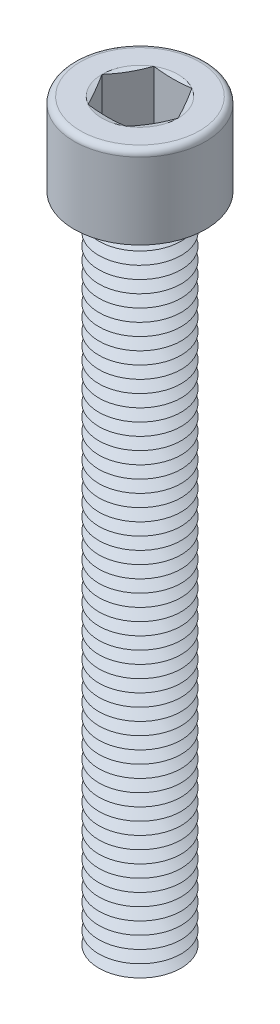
from build123d import *

# Parameters (mm, degrees)
SKETCH1_R       = 5
EXTRUDE1_DEPTH  = 80
SKETCH2_R       = 8
EXTRUDE2_DEPTH  = 10
EXTRUDE3_DEPTH  = 8
FILLET1_R       = 0.75
LPATTERN1_COUNT = 53
LPATTERN1_PITCH = 1.5


with BuildPart() as part:
    # Sketch1 → Extrude1 (new body)
    with BuildSketch(Plane(origin=(0, 0, 0), x_dir=(1, 0, 0), z_dir=(0, 1, 0))):
        with Locations(Location((0, 0, 0), (0, 0, 270))):
            Circle(SKETCH1_R)
    extrude(amount=EXTRUDE1_DEPTH)

    # Sketch2 → Extrude2 (add)
    with BuildSketch(Plane(origin=(0, 80, 0), x_dir=(1, 0, 0), z_dir=(0, 1, 0))):
        with Locations(Location((0, 0, 0), (0, 0, 270))):
            Circle(SKETCH2_R)
    extrude(amount=EXTRUDE2_DEPTH)

    # Sketch3 → Extrude3 (cut)
    with BuildSketch(Plane(origin=(0, 90, 0), x_dir=(1, 0, 0), z_dir=(0, 1, 0))):
        Polygon((2.309401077, 4), (-2.309401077, 4), (-4.618802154, 0), (-2.309401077, -4), (2.309401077, -4), (4.618802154, 0), align=None)
    extrude(amount=-EXTRUDE3_DEPTH, mode=Mode.SUBTRACT)

    # Fillet1
    fillet1_edges = [part.edges().sort_by_distance(p)[0] for p in [
        (0, 90, -8),
    ]]
    fillet(fillet1_edges, radius=FILLET1_R)

    # Sketch4 → Cut-Revolve1 (revolve, cut)
    with BuildSketch(Plane(origin=(0, 0, 0), x_dir=(0, 0, -1), z_dir=(1, 0, 0))):
        Polygon((-4, 82), (0, 82), (0, 79.690598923), align=None)
    revolve(axis=Axis((0, 82, 0), (0, -1, 0)), mode=Mode.SUBTRACT)

    # Sketch5 → Cut-Revolve2 (revolve, cut)
    with BuildSketch(Plane.XY, mode=Mode.PRIVATE) as cut_revolve2_sk:
        Polygon((-5, 0.75), (-5, -0.75), (-3.700961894, 0), align=None)
    cut_revolve2 = revolve(cut_revolve2_sk.sketch.rotate(Axis((0, 80, 0), (0, -1, 0)), 270), axis=Axis((0, 80, 0), (0, -1, 0)), mode=Mode.SUBTRACT)

    # LPattern1: Cut-Revolve2 ×53
    with Locations(*[(0, i * LPATTERN1_PITCH, 0) for i in range(1, LPATTERN1_COUNT)]):
        add(cut_revolve2, mode=Mode.SUBTRACT)

    # Extrude4 cone 1 section (on through the dimple's axis) → Extrude4 (revolve, cut)
    with BuildSketch(Plane(origin=(0, 90, 0), x_dir=(0, 0, 1), z_dir=(1, 0, 0))):
        Polygon((0, 0), (4.618802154, 0), (0, 1.237604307), align=None)
    revolve(axis=Axis((0, 90, 0), (0, -1, 0)), mode=Mode.SUBTRACT)


solid = part.part
